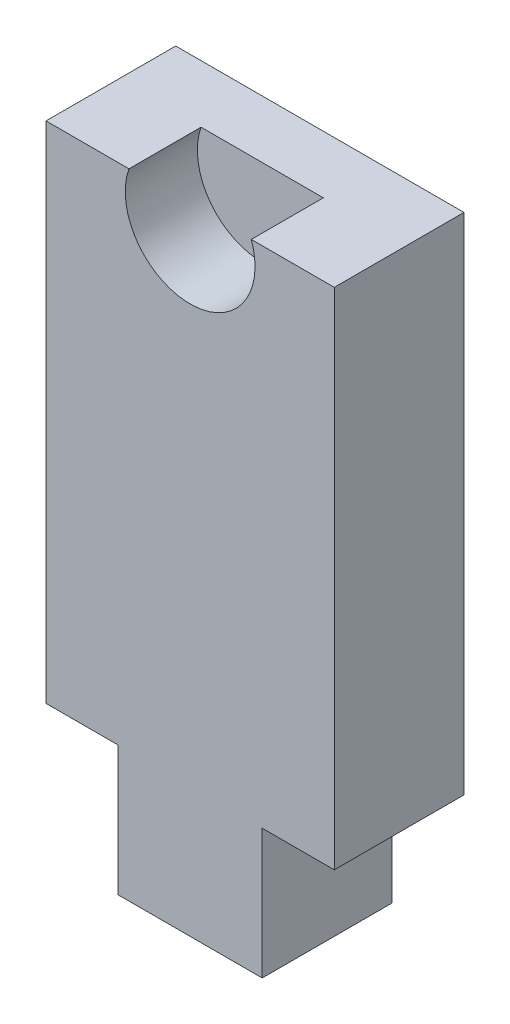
from build123d import *

# Parameters (mm, degrees)
SKETCH1_W           = 40
SKETCH1_H           = 70
BOSS_EXTRUDE1_DEPTH = 18
SKETCH2_R           = 9
CUT_EXTRUDE1_DEPTH  = 10
SKETCH3_W           = 20
SKETCH3_H           = 18
BOSS_EXTRUDE2_DEPTH = 18


with BuildPart() as part:
    # Sketch1 → Boss-Extrude1 (new body)
    with BuildSketch(Plane.XY):
        Rectangle(SKETCH1_W, SKETCH1_H)
    extrude(amount=BOSS_EXTRUDE1_DEPTH)

    # Sketch2 → Cut-Extrude1 (cut)
    with BuildSketch(Plane.XY.offset(18)):
        with Locations((0, 32.00213878)):
            Circle(SKETCH2_R)
    extrude(amount=-CUT_EXTRUDE1_DEPTH, mode=Mode.SUBTRACT)

    # Sketch3 → Boss-Extrude2 (add)
    with BuildSketch(Plane.XY.offset(18)):
        with Locations((0, -44)):
            Rectangle(SKETCH3_W, SKETCH3_H)
    extrude(amount=-BOSS_EXTRUDE2_DEPTH)


solid = part.part
